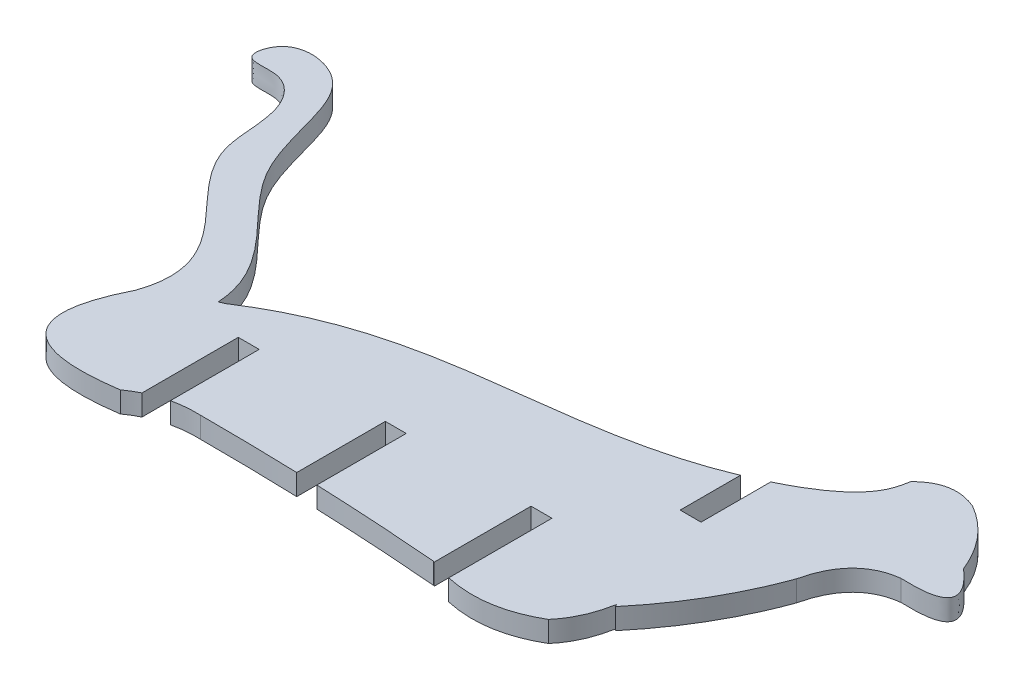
ISO-10303-21;
HEADER;
FILE_DESCRIPTION(('STEP AP214'),'2;1');
FILE_NAME('part.step','',(''),(''),'','','');
FILE_SCHEMA(('AUTOMOTIVE_DESIGN { 1 0 10303 214 1 1 1 1 }'));
ENDSEC;
DATA;
#1=APPLICATION_CONTEXT('core data for automotive mechanical design processes');
#2=APPLICATION_PROTOCOL_DEFINITION('international standard','automotive_design',2000,#1);
#3=PRODUCT_CONTEXT('',#1,'mechanical');
#4=PRODUCT('Part','Part','',(#3));
#5=PRODUCT_RELATED_PRODUCT_CATEGORY('part','',(#4));
#6=PRODUCT_DEFINITION_FORMATION('','',#4);
#7=PRODUCT_DEFINITION_CONTEXT('part definition',#1,'design');
#8=PRODUCT_DEFINITION('design','',#6,#7);
#9=PRODUCT_DEFINITION_SHAPE('','',#8);
#10=(LENGTH_UNIT() NAMED_UNIT(*) SI_UNIT(.MILLI.,.METRE.));
#11=(NAMED_UNIT(*) PLANE_ANGLE_UNIT() SI_UNIT($,.RADIAN.));
#12=(NAMED_UNIT(*) SI_UNIT($,.STERADIAN.) SOLID_ANGLE_UNIT());
#13=UNCERTAINTY_MEASURE_WITH_UNIT(LENGTH_MEASURE(1.E-05),#10,'distance_accuracy_value','');
#14=(GEOMETRIC_REPRESENTATION_CONTEXT(3) GLOBAL_UNCERTAINTY_ASSIGNED_CONTEXT((#13)) GLOBAL_UNIT_ASSIGNED_CONTEXT((#10,
#11,#12)) REPRESENTATION_CONTEXT('',''));
#15=CARTESIAN_POINT('',(0.,0.,0.));
#16=DIRECTION('',(0.,0.,1.));
#17=DIRECTION('',(1.,0.,0.));
#18=AXIS2_PLACEMENT_3D('',#15,#16,#17);
#19=CARTESIAN_POINT('',(75.5267501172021,3.,-42.9267503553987));
#20=CARTESIAN_POINT('',(73.2926366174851,3.,-48.5011073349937));
#21=CARTESIAN_POINT('',(68.4031861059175,3.,-51.3525451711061));
#22=B_SPLINE_CURVE_WITH_KNOTS('',2,(#19,#20,#21),.UNSPECIFIED.,.F.,.F.,(3,3),(0.,1.),.UNSPECIFIED.);
#23=DIRECTION('',(0.,-1.,0.));
#24=VECTOR('',#23,1.);
#25=SURFACE_OF_LINEAR_EXTRUSION('',#22,#24);
#26=CARTESIAN_POINT('',(75.5267501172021,0.,-42.9267503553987));
#27=CARTESIAN_POINT('',(73.2926366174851,0.,-48.5011073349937));
#28=CARTESIAN_POINT('',(68.4031861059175,0.,-51.3525451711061));
#29=B_SPLINE_CURVE_WITH_KNOTS('',2,(#26,#27,#28),.UNSPECIFIED.,.F.,.F.,(3,3),(0.,1.),.UNSPECIFIED.);
#30=CARTESIAN_POINT('',(75.5267501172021,0.,-42.9267503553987));
#31=VERTEX_POINT('',#30);
#32=CARTESIAN_POINT('',(68.4031861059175,0.,-51.3525451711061));
#33=VERTEX_POINT('',#32);
#34=EDGE_CURVE('E500',#31,#33,#29,.T.);
#35=ORIENTED_EDGE('',*,*,#34,.T.);
#36=DIRECTION('',(0.,-1.,0.));
#37=VECTOR('',#36,1.);
#38=CARTESIAN_POINT('',(68.4031861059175,3.,-51.3525451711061));
#39=LINE('',#38,#37);
#40=CARTESIAN_POINT('',(68.4031861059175,3.,-51.3525451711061));
#41=VERTEX_POINT('',#40);
#42=EDGE_CURVE('E11',#41,#33,#39,.T.);
#43=ORIENTED_EDGE('',*,*,#42,.F.);
#44=CARTESIAN_POINT('',(75.5267501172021,3.,-42.9267503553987));
#45=VERTEX_POINT('',#44);
#46=EDGE_CURVE('E632',#45,#41,#22,.T.);
#47=ORIENTED_EDGE('',*,*,#46,.F.);
#48=DIRECTION('',(0.,-1.,0.));
#49=VECTOR('',#48,1.);
#50=CARTESIAN_POINT('',(75.5267501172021,3.,-42.9267503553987));
#51=LINE('',#50,#49);
#52=EDGE_CURVE('E265',#45,#31,#51,.T.);
#53=ORIENTED_EDGE('',*,*,#52,.T.);
#54=EDGE_LOOP('',(#35,#43,#47,#53));
#55=FACE_BOUND('',#54,.T.);
#56=ADVANCED_FACE('F39',(#55),#25,.F.);
#57=CARTESIAN_POINT('',(68.4031861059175,3.,-51.3525451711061));
#58=CARTESIAN_POINT('',(64.0868815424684,3.,-53.226470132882));
#59=CARTESIAN_POINT('',(60.9012069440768,3.,-49.9551750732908));
#60=B_SPLINE_CURVE_WITH_KNOTS('',2,(#57,#58,#59),.UNSPECIFIED.,.F.,.F.,(3,3),(0.,1.),.UNSPECIFIED.);
#61=DIRECTION('',(0.,-1.,0.));
#62=VECTOR('',#61,1.);
#63=SURFACE_OF_LINEAR_EXTRUSION('',#60,#62);
#64=CARTESIAN_POINT('',(68.4031861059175,0.,-51.3525451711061));
#65=CARTESIAN_POINT('',(64.0868815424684,0.,-53.226470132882));
#66=CARTESIAN_POINT('',(60.9012069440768,0.,-49.9551750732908));
#67=B_SPLINE_CURVE_WITH_KNOTS('',2,(#64,#65,#66),.UNSPECIFIED.,.F.,.F.,(3,3),(0.,1.),.UNSPECIFIED.);
#68=CARTESIAN_POINT('',(60.9012069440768,0.,-49.9551750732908));
#69=VERTEX_POINT('',#68);
#70=EDGE_CURVE('E494',#33,#69,#67,.T.);
#71=ORIENTED_EDGE('',*,*,#70,.T.);
#72=DIRECTION('',(0.,-1.,0.));
#73=VECTOR('',#72,1.);
#74=CARTESIAN_POINT('',(60.9012069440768,3.,-49.9551750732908));
#75=LINE('',#74,#73);
#76=CARTESIAN_POINT('',(60.9012069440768,3.,-49.9551750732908));
#77=VERTEX_POINT('',#76);
#78=EDGE_CURVE('E48',#77,#69,#75,.T.);
#79=ORIENTED_EDGE('',*,*,#78,.F.);
#80=EDGE_CURVE('E165',#41,#77,#60,.T.);
#81=ORIENTED_EDGE('',*,*,#80,.F.);
#82=ORIENTED_EDGE('',*,*,#42,.T.);
#83=EDGE_LOOP('',(#71,#79,#81,#82));
#84=FACE_BOUND('',#83,.T.);
#85=ADVANCED_FACE('F663',(#84),#63,.F.);
#86=CARTESIAN_POINT('',(60.9012069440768,3.,-49.9551750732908));
#87=CARTESIAN_POINT('',(60.7554698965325,3.,-49.0949870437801));
#88=CARTESIAN_POINT('',(59.8189565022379,3.,-44.9436530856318));
#89=CARTESIAN_POINT('',(54.8907492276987,3.,-41.8215062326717));
#90=CARTESIAN_POINT('',(50.8937591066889,3.,-39.8804155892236));
#91=B_SPLINE_CURVE_WITH_KNOTS('',3,(#86,#87,#88,#89,#90),.UNSPECIFIED.,.F.,.F.,(4,1,4),
(0.191058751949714,0.219406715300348,0.344529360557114),.UNSPECIFIED.);
#92=DIRECTION('',(0.,-1.,0.));
#93=VECTOR('',#92,1.);
#94=SURFACE_OF_LINEAR_EXTRUSION('',#91,#93);
#95=CARTESIAN_POINT('',(60.9012069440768,0.,-49.9551750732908));
#96=CARTESIAN_POINT('',(60.7554698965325,0.,-49.0949870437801));
#97=CARTESIAN_POINT('',(59.8189565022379,0.,-44.9436530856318));
#98=CARTESIAN_POINT('',(54.8907492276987,0.,-41.8215062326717));
#99=CARTESIAN_POINT('',(50.8937591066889,0.,-39.8804155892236));
#100=B_SPLINE_CURVE_WITH_KNOTS('',3,(#95,#96,#97,#98,#99),.UNSPECIFIED.,.F.,.F.,(4,1,4),
(0.191058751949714,0.219406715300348,0.344529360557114),.UNSPECIFIED.);
#101=CARTESIAN_POINT('',(50.8937591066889,0.,-39.8804155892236));
#102=VERTEX_POINT('',#101);
#103=EDGE_CURVE('E488',#69,#102,#100,.T.);
#104=ORIENTED_EDGE('',*,*,#103,.T.);
#105=DIRECTION('',(0.,-1.,0.));
#106=VECTOR('',#105,1.);
#107=CARTESIAN_POINT('',(50.8937591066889,3.,-39.8804155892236));
#108=LINE('',#107,#106);
#109=CARTESIAN_POINT('',(50.8937591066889,3.,-39.8804155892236));
#110=VERTEX_POINT('',#109);
#111=EDGE_CURVE('E480',#110,#102,#108,.T.);
#112=ORIENTED_EDGE('',*,*,#111,.F.);
#113=EDGE_CURVE('E489',#77,#110,#91,.T.);
#114=ORIENTED_EDGE('',*,*,#113,.F.);
#115=ORIENTED_EDGE('',*,*,#78,.T.);
#116=EDGE_LOOP('',(#104,#112,#114,#115));
#117=FACE_BOUND('',#116,.T.);
#118=ADVANCED_FACE('F486',(#117),#94,.F.);
#119=CARTESIAN_POINT('',(50.8937591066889,3.,-39.8804155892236));
#120=DIRECTION('',(1.,0.,0.));
#121=DIRECTION('',(0.,0.,-1.));
#122=AXIS2_PLACEMENT_3D('',#119,#120,#121);
#123=PLANE('',#122);
#124=DIRECTION('',(0.,0.,1.));
#125=VECTOR('',#124,1.);
#126=CARTESIAN_POINT('',(50.8937591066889,0.,-39.8804155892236));
#127=LINE('',#126,#125);
#128=CARTESIAN_POINT('',(50.8937591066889,0.,-29.8804155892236));
#129=VERTEX_POINT('',#128);
#130=EDGE_CURVE('E496',#102,#129,#127,.T.);
#131=ORIENTED_EDGE('',*,*,#130,.T.);
#132=DIRECTION('',(0.,-1.,0.));
#133=VECTOR('',#132,1.);
#134=CARTESIAN_POINT('',(50.8937591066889,3.,-29.8804155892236));
#135=LINE('',#134,#133);
#136=CARTESIAN_POINT('',(50.8937591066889,3.,-29.8804155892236));
#137=VERTEX_POINT('',#136);
#138=EDGE_CURVE('E477',#137,#129,#135,.T.);
#139=ORIENTED_EDGE('',*,*,#138,.F.);
#140=DIRECTION('',(0.,0.,1.));
#141=VECTOR('',#140,1.);
#142=CARTESIAN_POINT('',(50.8937591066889,3.,-39.8804155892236));
#143=LINE('',#142,#141);
#144=EDGE_CURVE('E795',#110,#137,#143,.T.);
#145=ORIENTED_EDGE('',*,*,#144,.F.);
#146=ORIENTED_EDGE('',*,*,#111,.T.);
#147=EDGE_LOOP('',(#131,#139,#145,#146));
#148=FACE_BOUND('',#147,.T.);
#149=ADVANCED_FACE('F668',(#148),#123,.F.);
#150=CARTESIAN_POINT('',(50.8937591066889,3.,-29.8804155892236));
#151=DIRECTION('',(0.,0.,1.));
#152=DIRECTION('',(1.,0.,0.));
#153=AXIS2_PLACEMENT_3D('',#150,#151,#152);
#154=PLANE('',#153);
#155=DIRECTION('',(-1.,0.,0.));
#156=VECTOR('',#155,1.);
#157=CARTESIAN_POINT('',(50.8937591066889,0.,-29.8804155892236));
#158=LINE('',#157,#156);
#159=CARTESIAN_POINT('',(47.8937591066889,0.,-29.8804155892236));
#160=VERTEX_POINT('',#159);
#161=EDGE_CURVE('E498',#129,#160,#158,.T.);
#162=ORIENTED_EDGE('',*,*,#161,.T.);
#163=DIRECTION('',(0.,-1.,0.));
#164=VECTOR('',#163,1.);
#165=CARTESIAN_POINT('',(47.8937591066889,3.,-29.8804155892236));
#166=LINE('',#165,#164);
#167=CARTESIAN_POINT('',(47.8937591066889,3.,-29.8804155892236));
#168=VERTEX_POINT('',#167);
#169=EDGE_CURVE('E475',#168,#160,#166,.T.);
#170=ORIENTED_EDGE('',*,*,#169,.F.);
#171=DIRECTION('',(-1.,0.,0.));
#172=VECTOR('',#171,1.);
#173=CARTESIAN_POINT('',(50.8937591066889,3.,-29.8804155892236));
#174=LINE('',#173,#172);
#175=EDGE_CURVE('E793',#137,#168,#174,.T.);
#176=ORIENTED_EDGE('',*,*,#175,.F.);
#177=ORIENTED_EDGE('',*,*,#138,.T.);
#178=EDGE_LOOP('',(#162,#170,#176,#177));
#179=FACE_BOUND('',#178,.T.);
#180=ADVANCED_FACE('F671',(#179),#154,.F.);
#181=CARTESIAN_POINT('',(47.8937591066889,3.,-38.5314242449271));
#182=DIRECTION('',(1.,0.,0.));
#183=DIRECTION('',(0.,0.,-1.));
#184=AXIS2_PLACEMENT_3D('',#181,#182,#183);
#185=PLANE('',#184);
#186=DIRECTION('',(0.,0.,1.));
#187=VECTOR('',#186,1.);
#188=CARTESIAN_POINT('',(47.8937591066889,0.,-38.5314242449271));
#189=LINE('',#188,#187);
#190=CARTESIAN_POINT('',(47.8937591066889,0.,-38.5314242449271));
#191=VERTEX_POINT('',#190);
#192=EDGE_CURVE('E512',#191,#160,#189,.T.);
#193=ORIENTED_EDGE('',*,*,#192,.F.);
#194=DIRECTION('',(0.,-1.,0.));
#195=VECTOR('',#194,1.);
#196=CARTESIAN_POINT('',(47.8937591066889,3.,-38.5314242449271));
#197=LINE('',#196,#195);
#198=CARTESIAN_POINT('',(47.8937591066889,3.,-38.5314242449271));
#199=VERTEX_POINT('',#198);
#200=EDGE_CURVE('E473',#199,#191,#197,.T.);
#201=ORIENTED_EDGE('',*,*,#200,.F.);
#202=DIRECTION('',(0.,0.,1.));
#203=VECTOR('',#202,1.);
#204=CARTESIAN_POINT('',(47.8937591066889,3.,-38.5314242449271));
#205=LINE('',#204,#203);
#206=EDGE_CURVE('E694',#199,#168,#205,.T.);
#207=ORIENTED_EDGE('',*,*,#206,.T.);
#208=ORIENTED_EDGE('',*,*,#169,.T.);
#209=EDGE_LOOP('',(#193,#201,#207,#208));
#210=FACE_BOUND('',#209,.T.);
#211=ADVANCED_FACE('F675',(#210),#185,.T.);
#212=CARTESIAN_POINT('',(47.8937591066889,3.,-38.5314242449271));
#213=CARTESIAN_POINT('',(28.0082246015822,3.,-30.2806403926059));
#214=CARTESIAN_POINT('',(8.63555087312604,3.,-35.4977104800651));
#215=CARTESIAN_POINT('',(-10.3741587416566,3.,-22.9360710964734));
#216=B_SPLINE_CURVE_WITH_KNOTS('',3,(#212,#213,#214,#215),.UNSPECIFIED.,.F.,.F.,(4,4),
(0.375874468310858,1.),.UNSPECIFIED.);
#217=DIRECTION('',(0.,-1.,0.));
#218=VECTOR('',#217,1.);
#219=SURFACE_OF_LINEAR_EXTRUSION('',#216,#218);
#220=CARTESIAN_POINT('',(47.8937591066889,0.,-38.5314242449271));
#221=CARTESIAN_POINT('',(28.0082246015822,0.,-30.2806403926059));
#222=CARTESIAN_POINT('',(8.63555087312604,0.,-35.4977104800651));
#223=CARTESIAN_POINT('',(-10.3741587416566,0.,-22.9360710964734));
#224=B_SPLINE_CURVE_WITH_KNOTS('',3,(#220,#221,#222,#223),.UNSPECIFIED.,.F.,.F.,(4,4),
(0.375874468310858,1.),.UNSPECIFIED.);
#225=CARTESIAN_POINT('',(-10.3741587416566,0.,-22.9360710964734));
#226=VERTEX_POINT('',#225);
#227=EDGE_CURVE('E515',#191,#226,#224,.T.);
#228=ORIENTED_EDGE('',*,*,#227,.T.);
#229=DIRECTION('',(0.,-1.,0.));
#230=VECTOR('',#229,1.);
#231=CARTESIAN_POINT('',(-10.3741587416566,3.,-22.9360710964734));
#232=LINE('',#231,#230);
#233=CARTESIAN_POINT('',(-10.3741587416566,3.,-22.9360710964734));
#234=VERTEX_POINT('',#233);
#235=EDGE_CURVE('E471',#234,#226,#232,.T.);
#236=ORIENTED_EDGE('',*,*,#235,.F.);
#237=EDGE_CURVE('E688',#199,#234,#216,.T.);
#238=ORIENTED_EDGE('',*,*,#237,.F.);
#239=ORIENTED_EDGE('',*,*,#200,.T.);
#240=EDGE_LOOP('',(#228,#236,#238,#239));
#241=FACE_BOUND('',#240,.T.);
#242=ADVANCED_FACE('F679',(#241),#219,.F.);
#243=CARTESIAN_POINT('',(-11.1356610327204,3.,-22.6005868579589));
#244=CARTESIAN_POINT('',(-10.8830760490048,3.,-22.7149187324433));
#245=CARTESIAN_POINT('',(-10.6292179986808,3.,-22.8267266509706));
#246=CARTESIAN_POINT('',(-10.3741587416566,3.,-22.9360710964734));
#247=B_SPLINE_CURVE_WITH_KNOTS('',3,(#243,#244,#245,#246),.UNSPECIFIED.,.F.,.F.,(4,4),
(0.550254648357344,0.571137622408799),.UNSPECIFIED.);
#248=DIRECTION('',(0.,-1.,0.));
#249=VECTOR('',#248,1.);
#250=SURFACE_OF_LINEAR_EXTRUSION('',#247,#249);
#251=CARTESIAN_POINT('',(-11.1356610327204,0.,-22.6005868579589));
#252=CARTESIAN_POINT('',(-10.8830760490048,0.,-22.7149187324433));
#253=CARTESIAN_POINT('',(-10.6292179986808,0.,-22.8267266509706));
#254=CARTESIAN_POINT('',(-10.3741587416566,0.,-22.9360710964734));
#255=B_SPLINE_CURVE_WITH_KNOTS('',3,(#251,#252,#253,#254),.UNSPECIFIED.,.F.,.F.,(4,4),
(0.550254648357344,0.571137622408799),.UNSPECIFIED.);
#256=CARTESIAN_POINT('',(-11.1356610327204,0.,-22.6005868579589));
#257=VERTEX_POINT('',#256);
#258=EDGE_CURVE('E520',#257,#226,#255,.T.);
#259=ORIENTED_EDGE('',*,*,#258,.F.);
#260=DIRECTION('',(0.,-1.,0.));
#261=VECTOR('',#260,1.);
#262=CARTESIAN_POINT('',(-11.1356610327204,3.,-22.6005868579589));
#263=LINE('',#262,#261);
#264=CARTESIAN_POINT('',(-11.1356610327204,3.,-22.6005868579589));
#265=VERTEX_POINT('',#264);
#266=EDGE_CURVE('E469',#265,#257,#263,.T.);
#267=ORIENTED_EDGE('',*,*,#266,.F.);
#268=EDGE_CURVE('E693',#265,#234,#247,.T.);
#269=ORIENTED_EDGE('',*,*,#268,.T.);
#270=ORIENTED_EDGE('',*,*,#235,.T.);
#271=EDGE_LOOP('',(#259,#267,#269,#270));
#272=FACE_BOUND('',#271,.T.);
#273=ADVANCED_FACE('F684',(#272),#250,.T.);
#274=CARTESIAN_POINT('',(-18.5169229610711,3.,-18.1507684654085));
#275=CARTESIAN_POINT('',(-14.5119069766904,3.,-29.5343408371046));
#276=CARTESIAN_POINT('',(-31.9797482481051,3.,-35.3707884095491));
#277=CARTESIAN_POINT('',(-29.751622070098,3.,-50.7343949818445));
#278=CARTESIAN_POINT('',(-34.4462313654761,3.,-55.8402008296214));
#279=CARTESIAN_POINT('',(-40.1218133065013,3.,-54.4079761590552));
#280=CARTESIAN_POINT('',(-38.519478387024,3.,-60.889337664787));
#281=CARTESIAN_POINT('',(-29.6520657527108,3.,-59.951009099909));
#282=CARTESIAN_POINT('',(-26.7788534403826,3.,-51.1561648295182));
#283=CARTESIAN_POINT('',(-23.5382847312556,3.,-37.4118977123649));
#284=CARTESIAN_POINT('',(-11.646426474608,3.,-31.263472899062));
#285=CARTESIAN_POINT('',(-11.1356610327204,3.,-22.6005868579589));
#286=B_SPLINE_CURVE_WITH_KNOTS('',3,(#274,#275,#276,#277,#278,#279,#280,#281,#282,#283,#284,
#285),.UNSPECIFIED.,.F.,.F.,(4,1,1,1,1,1,1,1,1,4),(0.,0.276371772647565,0.375366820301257,
0.42621598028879,0.467018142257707,0.496246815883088,0.571537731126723,0.65596278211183,
0.760228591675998,1.),.UNSPECIFIED.);
#287=DIRECTION('',(0.,-1.,0.));
#288=VECTOR('',#287,1.);
#289=SURFACE_OF_LINEAR_EXTRUSION('',#286,#288);
#290=CARTESIAN_POINT('',(-18.5169229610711,0.,-18.1507684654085));
#291=CARTESIAN_POINT('',(-14.5119069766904,0.,-29.5343408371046));
#292=CARTESIAN_POINT('',(-31.9797482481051,0.,-35.3707884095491));
#293=CARTESIAN_POINT('',(-29.751622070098,0.,-50.7343949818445));
#294=CARTESIAN_POINT('',(-34.4462313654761,0.,-55.8402008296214));
#295=CARTESIAN_POINT('',(-40.1218133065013,0.,-54.4079761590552));
#296=CARTESIAN_POINT('',(-38.519478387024,0.,-60.889337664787));
#297=CARTESIAN_POINT('',(-29.6520657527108,0.,-59.951009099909));
#298=CARTESIAN_POINT('',(-26.7788534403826,0.,-51.1561648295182));
#299=CARTESIAN_POINT('',(-23.5382847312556,0.,-37.4118977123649));
#300=CARTESIAN_POINT('',(-11.646426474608,0.,-31.263472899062));
#301=CARTESIAN_POINT('',(-11.1356610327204,0.,-22.6005868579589));
#302=B_SPLINE_CURVE_WITH_KNOTS('',3,(#290,#291,#292,#293,#294,#295,#296,#297,#298,#299,#300,
#301),.UNSPECIFIED.,.F.,.F.,(4,1,1,1,1,1,1,1,1,4),(0.,0.276371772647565,0.375366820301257,
0.42621598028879,0.467018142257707,0.496246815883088,0.571537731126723,0.65596278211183,
0.760228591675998,1.),.UNSPECIFIED.);
#303=CARTESIAN_POINT('',(-18.5169229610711,0.,-18.1507684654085));
#304=VERTEX_POINT('',#303);
#305=EDGE_CURVE('E528',#304,#257,#302,.T.);
#306=ORIENTED_EDGE('',*,*,#305,.F.);
#307=DIRECTION('',(0.,-1.,0.));
#308=VECTOR('',#307,1.);
#309=CARTESIAN_POINT('',(-18.5169229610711,3.,-18.1507684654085));
#310=LINE('',#309,#308);
#311=CARTESIAN_POINT('',(-18.5169229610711,3.,-18.1507684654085));
#312=VERTEX_POINT('',#311);
#313=EDGE_CURVE('E467',#312,#304,#310,.T.);
#314=ORIENTED_EDGE('',*,*,#313,.F.);
#315=EDGE_CURVE('E704',#312,#265,#286,.T.);
#316=ORIENTED_EDGE('',*,*,#315,.T.);
#317=ORIENTED_EDGE('',*,*,#266,.T.);
#318=EDGE_LOOP('',(#306,#314,#316,#317));
#319=FACE_BOUND('',#318,.T.);
#320=ADVANCED_FACE('F721',(#319),#289,.T.);
#321=CARTESIAN_POINT('',(-18.5169229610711,3.,-18.1507684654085));
#322=CARTESIAN_POINT('',(-26.7522707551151,3.,-1.77084566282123));
#323=CARTESIAN_POINT('',(-7.23371668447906,3.,-4.64367499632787));
#324=B_SPLINE_CURVE_WITH_KNOTS('',2,(#321,#322,#323),.UNSPECIFIED.,.F.,.F.,(3,3),(0.,1.),.UNSPECIFIED.);
#325=DIRECTION('',(0.,-1.,0.));
#326=VECTOR('',#325,1.);
#327=SURFACE_OF_LINEAR_EXTRUSION('',#324,#326);
#328=CARTESIAN_POINT('',(-18.5169229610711,0.,-18.1507684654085));
#329=CARTESIAN_POINT('',(-26.7522707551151,0.,-1.77084566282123));
#330=CARTESIAN_POINT('',(-7.23371668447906,0.,-4.64367499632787));
#331=B_SPLINE_CURVE_WITH_KNOTS('',2,(#328,#329,#330),.UNSPECIFIED.,.F.,.F.,(3,3),(0.,1.),.UNSPECIFIED.);
#332=CARTESIAN_POINT('',(-7.23371668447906,0.,-4.64367499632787));
#333=VERTEX_POINT('',#332);
#334=EDGE_CURVE('E536',#304,#333,#331,.T.);
#335=ORIENTED_EDGE('',*,*,#334,.T.);
#336=DIRECTION('',(0.,-1.,0.));
#337=VECTOR('',#336,1.);
#338=CARTESIAN_POINT('',(-7.23371668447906,3.,-4.64367499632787));
#339=LINE('',#338,#337);
#340=CARTESIAN_POINT('',(-7.23371668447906,3.,-4.64367499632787));
#341=VERTEX_POINT('',#340);
#342=EDGE_CURVE('E465',#341,#333,#339,.T.);
#343=ORIENTED_EDGE('',*,*,#342,.F.);
#344=EDGE_CURVE('E713',#312,#341,#324,.T.);
#345=ORIENTED_EDGE('',*,*,#344,.F.);
#346=ORIENTED_EDGE('',*,*,#313,.T.);
#347=EDGE_LOOP('',(#335,#343,#345,#346));
#348=FACE_BOUND('',#347,.T.);
#349=ADVANCED_FACE('F724',(#348),#327,.F.);
#350=CARTESIAN_POINT('',(-5.29340051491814,3.,-5.82263575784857));
#351=CARTESIAN_POINT('',(-5.96443170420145,3.,-5.48790715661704));
#352=CARTESIAN_POINT('',(-6.61120376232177,3.,-5.09492023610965));
#353=CARTESIAN_POINT('',(-7.23371668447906,3.,-4.64367499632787));
#354=B_SPLINE_CURVE_WITH_KNOTS('',3,(#350,#351,#352,#353),.UNSPECIFIED.,.F.,.F.,(4,4),
(0.757247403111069,1.),.UNSPECIFIED.);
#355=DIRECTION('',(0.,-1.,0.));
#356=VECTOR('',#355,1.);
#357=SURFACE_OF_LINEAR_EXTRUSION('',#354,#356);
#358=CARTESIAN_POINT('',(-5.29340051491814,0.,-5.82263575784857));
#359=CARTESIAN_POINT('',(-5.96443170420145,0.,-5.48790715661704));
#360=CARTESIAN_POINT('',(-6.61120376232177,0.,-5.09492023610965));
#361=CARTESIAN_POINT('',(-7.23371668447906,0.,-4.64367499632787));
#362=B_SPLINE_CURVE_WITH_KNOTS('',3,(#358,#359,#360,#361),.UNSPECIFIED.,.F.,.F.,(4,4),
(0.757247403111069,1.),.UNSPECIFIED.);
#363=CARTESIAN_POINT('',(-5.29340051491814,0.,-5.82263575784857));
#364=VERTEX_POINT('',#363);
#365=EDGE_CURVE('E544',#364,#333,#362,.T.);
#366=ORIENTED_EDGE('',*,*,#365,.F.);
#367=DIRECTION('',(0.,-1.,0.));
#368=VECTOR('',#367,1.);
#369=CARTESIAN_POINT('',(-5.29340051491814,3.,-5.82263575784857));
#370=LINE('',#369,#368);
#371=CARTESIAN_POINT('',(-5.29340051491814,3.,-5.82263575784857));
#372=VERTEX_POINT('',#371);
#373=EDGE_CURVE('E463',#372,#364,#370,.T.);
#374=ORIENTED_EDGE('',*,*,#373,.F.);
#375=EDGE_CURVE('E735',#372,#341,#354,.T.);
#376=ORIENTED_EDGE('',*,*,#375,.T.);
#377=ORIENTED_EDGE('',*,*,#342,.T.);
#378=EDGE_LOOP('',(#366,#374,#376,#377));
#379=FACE_BOUND('',#378,.T.);
#380=ADVANCED_FACE('F728',(#379),#357,.T.);
#381=CARTESIAN_POINT('',(-5.29340051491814,3.,-19.6436749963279));
#382=DIRECTION('',(1.,0.,0.));
#383=DIRECTION('',(0.,0.,-1.));
#384=AXIS2_PLACEMENT_3D('',#381,#382,#383);
#385=PLANE('',#384);
#386=DIRECTION('',(0.,0.,1.));
#387=VECTOR('',#386,1.);
#388=CARTESIAN_POINT('',(-5.29340051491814,0.,-19.6436749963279));
#389=LINE('',#388,#387);
#390=CARTESIAN_POINT('',(-5.29340051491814,0.,-19.6436749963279));
#391=VERTEX_POINT('',#390);
#392=EDGE_CURVE('E552',#391,#364,#389,.T.);
#393=ORIENTED_EDGE('',*,*,#392,.F.);
#394=DIRECTION('',(0.,-1.,0.));
#395=VECTOR('',#394,1.);
#396=CARTESIAN_POINT('',(-5.29340051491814,3.,-19.6436749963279));
#397=LINE('',#396,#395);
#398=CARTESIAN_POINT('',(-5.29340051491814,3.,-19.6436749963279));
#399=VERTEX_POINT('',#398);
#400=EDGE_CURVE('E461',#399,#391,#397,.T.);
#401=ORIENTED_EDGE('',*,*,#400,.F.);
#402=DIRECTION('',(0.,0.,1.));
#403=VECTOR('',#402,1.);
#404=CARTESIAN_POINT('',(-5.29340051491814,3.,-19.6436749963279));
#405=LINE('',#404,#403);
#406=EDGE_CURVE('E741',#399,#372,#405,.T.);
#407=ORIENTED_EDGE('',*,*,#406,.T.);
#408=ORIENTED_EDGE('',*,*,#373,.T.);
#409=EDGE_LOOP('',(#393,#401,#407,#408));
#410=FACE_BOUND('',#409,.T.);
#411=ADVANCED_FACE('F732',(#410),#385,.T.);
#412=CARTESIAN_POINT('',(-5.29340051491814,3.,-19.6436749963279));
#413=DIRECTION('',(0.,0.,-1.));
#414=DIRECTION('',(-1.,0.,0.));
#415=AXIS2_PLACEMENT_3D('',#412,#413,#414);
#416=PLANE('',#415);
#417=DIRECTION('',(1.,0.,0.));
#418=VECTOR('',#417,1.);
#419=CARTESIAN_POINT('',(-5.29340051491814,0.,-19.6436749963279));
#420=LINE('',#419,#418);
#421=CARTESIAN_POINT('',(-2.29340050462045,0.,-19.6436749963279));
#422=VERTEX_POINT('',#421);
#423=EDGE_CURVE('E558',#391,#422,#420,.T.);
#424=ORIENTED_EDGE('',*,*,#423,.T.);
#425=DIRECTION('',(0.,-1.,0.));
#426=VECTOR('',#425,1.);
#427=CARTESIAN_POINT('',(-2.29340050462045,3.,-19.6436749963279));
#428=LINE('',#427,#426);
#429=CARTESIAN_POINT('',(-2.29340050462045,3.,-19.6436749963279));
#430=VERTEX_POINT('',#429);
#431=EDGE_CURVE('E458',#430,#422,#428,.T.);
#432=ORIENTED_EDGE('',*,*,#431,.F.);
#433=DIRECTION('',(1.,0.,0.));
#434=VECTOR('',#433,1.);
#435=CARTESIAN_POINT('',(-5.29340051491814,3.,-19.6436749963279));
#436=LINE('',#435,#434);
#437=EDGE_CURVE('E747',#399,#430,#436,.T.);
#438=ORIENTED_EDGE('',*,*,#437,.F.);
#439=ORIENTED_EDGE('',*,*,#400,.T.);
#440=EDGE_LOOP('',(#424,#432,#438,#439));
#441=FACE_BOUND('',#440,.T.);
#442=ADVANCED_FACE('F771',(#441),#416,.F.);
#443=CARTESIAN_POINT('',(-2.29340050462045,3.,-19.6436749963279));
#444=DIRECTION('',(1.,0.,0.));
#445=DIRECTION('',(0.,0.,-1.));
#446=AXIS2_PLACEMENT_3D('',#443,#444,#445);
#447=PLANE('',#446);
#448=DIRECTION('',(0.,0.,1.));
#449=VECTOR('',#448,1.);
#450=CARTESIAN_POINT('',(-2.29340050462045,0.,-19.6436749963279));
#451=LINE('',#450,#449);
#452=CARTESIAN_POINT('',(-2.29340050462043,0.,-6.89494034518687));
#453=VERTEX_POINT('',#452);
#454=EDGE_CURVE('E560',#422,#453,#451,.T.);
#455=ORIENTED_EDGE('',*,*,#454,.T.);
#456=DIRECTION('',(0.,-1.,0.));
#457=VECTOR('',#456,1.);
#458=CARTESIAN_POINT('',(-2.29340050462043,3.,-6.89494034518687));
#459=LINE('',#458,#457);
#460=CARTESIAN_POINT('',(-2.29340050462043,3.,-6.89494034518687));
#461=VERTEX_POINT('',#460);
#462=EDGE_CURVE('E456',#461,#453,#459,.T.);
#463=ORIENTED_EDGE('',*,*,#462,.F.);
#464=DIRECTION('',(0.,0.,1.));
#465=VECTOR('',#464,1.);
#466=CARTESIAN_POINT('',(-2.29340050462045,3.,-19.6436749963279));
#467=LINE('',#466,#465);
#468=EDGE_CURVE('E748',#430,#461,#467,.T.);
#469=ORIENTED_EDGE('',*,*,#468,.F.);
#470=ORIENTED_EDGE('',*,*,#431,.T.);
#471=EDGE_LOOP('',(#455,#463,#469,#470));
#472=FACE_BOUND('',#471,.T.);
#473=ADVANCED_FACE('F767',(#472),#447,.F.);
#474=CARTESIAN_POINT('',(1.69446574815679,3.,-7.25441614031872));
#475=CARTESIAN_POINT('',(-0.404856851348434,3.,-7.32777111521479));
#476=CARTESIAN_POINT('',(-2.29340050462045,3.,-6.89494034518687));
#477=B_SPLINE_CURVE_WITH_KNOTS('',2,(#474,#475,#476),.UNSPECIFIED.,.F.,.F.,(3,3),(0.,
0.413122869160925),.UNSPECIFIED.);
#478=DIRECTION('',(0.,-1.,0.));
#479=VECTOR('',#478,1.);
#480=SURFACE_OF_LINEAR_EXTRUSION('',#477,#479);
#481=CARTESIAN_POINT('',(1.69446574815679,0.,-7.25441614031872));
#482=CARTESIAN_POINT('',(-0.404856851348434,0.,-7.32777111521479));
#483=CARTESIAN_POINT('',(-2.29340050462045,0.,-6.89494034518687));
#484=B_SPLINE_CURVE_WITH_KNOTS('',2,(#481,#482,#483),.UNSPECIFIED.,.F.,.F.,(3,3),(0.,
0.413122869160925),.UNSPECIFIED.);
#485=CARTESIAN_POINT('',(1.69446574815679,0.,-7.25441614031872));
#486=VERTEX_POINT('',#485);
#487=EDGE_CURVE('E563',#486,#453,#484,.T.);
#488=ORIENTED_EDGE('',*,*,#487,.F.);
#489=DIRECTION('',(0.,-1.,0.));
#490=VECTOR('',#489,1.);
#491=CARTESIAN_POINT('',(1.69446574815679,3.,-7.25441614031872));
#492=LINE('',#491,#490);
#493=CARTESIAN_POINT('',(1.69446574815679,3.,-7.25441614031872));
#494=VERTEX_POINT('',#493);
#495=EDGE_CURVE('E454',#494,#486,#492,.T.);
#496=ORIENTED_EDGE('',*,*,#495,.F.);
#497=EDGE_CURVE('E376',#494,#461,#477,.T.);
#498=ORIENTED_EDGE('',*,*,#497,.T.);
#499=ORIENTED_EDGE('',*,*,#462,.T.);
#500=EDGE_LOOP('',(#488,#496,#498,#499));
#501=FACE_BOUND('',#500,.T.);
#502=ADVANCED_FACE('F365',(#501),#480,.T.);
#503=CARTESIAN_POINT('',(15.7065994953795,3.,-7.03183954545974));
#504=CARTESIAN_POINT('',(11.0380928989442,3.,-7.18430130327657));
#505=CARTESIAN_POINT('',(6.36738165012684,3.,-7.25849350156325));
#506=CARTESIAN_POINT('',(1.69446574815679,3.,-7.25441614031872));
#507=B_SPLINE_CURVE_WITH_KNOTS('',3,(#503,#504,#505,#506),.UNSPECIFIED.,.F.,.F.,(4,4),
(0.702434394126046,1.),.UNSPECIFIED.);
#508=DIRECTION('',(0.,-1.,0.));
#509=VECTOR('',#508,1.);
#510=SURFACE_OF_LINEAR_EXTRUSION('',#507,#509);
#511=CARTESIAN_POINT('',(15.7065994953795,0.,-7.03183954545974));
#512=CARTESIAN_POINT('',(11.0380928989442,0.,-7.18430130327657));
#513=CARTESIAN_POINT('',(6.36738165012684,0.,-7.25849350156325));
#514=CARTESIAN_POINT('',(1.69446574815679,0.,-7.25441614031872));
#515=B_SPLINE_CURVE_WITH_KNOTS('',3,(#511,#512,#513,#514),.UNSPECIFIED.,.F.,.F.,(4,4),
(0.702434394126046,1.),.UNSPECIFIED.);
#516=CARTESIAN_POINT('',(15.7065994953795,0.,-7.03183954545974));
#517=VERTEX_POINT('',#516);
#518=EDGE_CURVE('E568',#517,#486,#515,.T.);
#519=ORIENTED_EDGE('',*,*,#518,.F.);
#520=DIRECTION('',(0.,-1.,0.));
#521=VECTOR('',#520,1.);
#522=CARTESIAN_POINT('',(15.7065994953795,3.,-7.03183954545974));
#523=LINE('',#522,#521);
#524=CARTESIAN_POINT('',(15.7065994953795,3.,-7.03183954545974));
#525=VERTEX_POINT('',#524);
#526=EDGE_CURVE('E452',#525,#517,#523,.T.);
#527=ORIENTED_EDGE('',*,*,#526,.F.);
#528=EDGE_CURVE('E369',#525,#494,#507,.T.);
#529=ORIENTED_EDGE('',*,*,#528,.T.);
#530=ORIENTED_EDGE('',*,*,#495,.T.);
#531=EDGE_LOOP('',(#519,#527,#529,#530));
#532=FACE_BOUND('',#531,.T.);
#533=ADVANCED_FACE('F360',(#532),#510,.T.);
#534=CARTESIAN_POINT('',(15.7065994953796,3.,-19.7493601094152));
#535=DIRECTION('',(1.,0.,0.));
#536=DIRECTION('',(0.,0.,-1.));
#537=AXIS2_PLACEMENT_3D('',#534,#535,#536);
#538=PLANE('',#537);
#539=DIRECTION('',(0.,0.,1.));
#540=VECTOR('',#539,1.);
#541=CARTESIAN_POINT('',(15.7065994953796,0.,-19.7493601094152));
#542=LINE('',#541,#540);
#543=CARTESIAN_POINT('',(15.7065994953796,0.,-19.7493601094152));
#544=VERTEX_POINT('',#543);
#545=EDGE_CURVE('E576',#544,#517,#542,.T.);
#546=ORIENTED_EDGE('',*,*,#545,.F.);
#547=DIRECTION('',(0.,-1.,0.));
#548=VECTOR('',#547,1.);
#549=CARTESIAN_POINT('',(15.7065994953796,3.,-19.7493601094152));
#550=LINE('',#549,#548);
#551=CARTESIAN_POINT('',(15.7065994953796,3.,-19.7493601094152));
#552=VERTEX_POINT('',#551);
#553=EDGE_CURVE('E450',#552,#544,#550,.T.);
#554=ORIENTED_EDGE('',*,*,#553,.F.);
#555=DIRECTION('',(0.,0.,1.));
#556=VECTOR('',#555,1.);
#557=CARTESIAN_POINT('',(15.7065994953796,3.,-19.7493601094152));
#558=LINE('',#557,#556);
#559=EDGE_CURVE('E375',#552,#525,#558,.T.);
#560=ORIENTED_EDGE('',*,*,#559,.T.);
#561=ORIENTED_EDGE('',*,*,#526,.T.);
#562=EDGE_LOOP('',(#546,#554,#560,#561));
#563=FACE_BOUND('',#562,.T.);
#564=ADVANCED_FACE('F356',(#563),#538,.T.);
#565=CARTESIAN_POINT('',(15.7065994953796,3.,-19.7493601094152));
#566=DIRECTION('',(0.,0.,-1.));
#567=DIRECTION('',(-1.,0.,0.));
#568=AXIS2_PLACEMENT_3D('',#565,#566,#567);
#569=PLANE('',#568);
#570=DIRECTION('',(1.,0.,0.));
#571=VECTOR('',#570,1.);
#572=CARTESIAN_POINT('',(15.7065994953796,0.,-19.7493601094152));
#573=LINE('',#572,#571);
#574=CARTESIAN_POINT('',(18.7065995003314,0.,-19.7493601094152));
#575=VERTEX_POINT('',#574);
#576=EDGE_CURVE('E582',#544,#575,#573,.T.);
#577=ORIENTED_EDGE('',*,*,#576,.T.);
#578=DIRECTION('',(0.,-1.,0.));
#579=VECTOR('',#578,1.);
#580=CARTESIAN_POINT('',(18.7065995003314,3.,-19.7493601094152));
#581=LINE('',#580,#579);
#582=CARTESIAN_POINT('',(18.7065995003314,3.,-19.7493601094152));
#583=VERTEX_POINT('',#582);
#584=EDGE_CURVE('E447',#583,#575,#581,.T.);
#585=ORIENTED_EDGE('',*,*,#584,.F.);
#586=DIRECTION('',(1.,0.,0.));
#587=VECTOR('',#586,1.);
#588=CARTESIAN_POINT('',(15.7065994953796,3.,-19.7493601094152));
#589=LINE('',#588,#587);
#590=EDGE_CURVE('E386',#552,#583,#589,.T.);
#591=ORIENTED_EDGE('',*,*,#590,.F.);
#592=ORIENTED_EDGE('',*,*,#553,.T.);
#593=EDGE_LOOP('',(#577,#585,#591,#592));
#594=FACE_BOUND('',#593,.T.);
#595=ADVANCED_FACE('F352',(#594),#569,.F.);
#596=CARTESIAN_POINT('',(18.7065995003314,3.,-19.7493601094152));
#597=DIRECTION('',(1.,0.,0.));
#598=DIRECTION('',(0.,0.,-1.));
#599=AXIS2_PLACEMENT_3D('',#596,#597,#598);
#600=PLANE('',#599);
#601=DIRECTION('',(0.,0.,1.));
#602=VECTOR('',#601,1.);
#603=CARTESIAN_POINT('',(18.7065995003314,0.,-19.7493601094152));
#604=LINE('',#603,#602);
#605=CARTESIAN_POINT('',(18.7065995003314,0.,-6.92308141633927));
#606=VERTEX_POINT('',#605);
#607=EDGE_CURVE('E584',#575,#606,#604,.T.);
#608=ORIENTED_EDGE('',*,*,#607,.T.);
#609=DIRECTION('',(0.,-1.,0.));
#610=VECTOR('',#609,1.);
#611=CARTESIAN_POINT('',(18.7065995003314,3.,-6.92308141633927));
#612=LINE('',#611,#610);
#613=CARTESIAN_POINT('',(18.7065995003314,3.,-6.92308141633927));
#614=VERTEX_POINT('',#613);
#615=EDGE_CURVE('E393',#614,#606,#612,.T.);
#616=ORIENTED_EDGE('',*,*,#615,.F.);
#617=DIRECTION('',(0.,0.,1.));
#618=VECTOR('',#617,1.);
#619=CARTESIAN_POINT('',(18.7065995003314,3.,-19.7493601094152));
#620=LINE('',#619,#618);
#621=EDGE_CURVE('E387',#583,#614,#620,.T.);
#622=ORIENTED_EDGE('',*,*,#621,.F.);
#623=ORIENTED_EDGE('',*,*,#584,.T.);
#624=EDGE_LOOP('',(#608,#616,#622,#623));
#625=FACE_BOUND('',#624,.T.);
#626=ADVANCED_FACE('F348',(#625),#600,.F.);
#627=CARTESIAN_POINT('',(36.5573555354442,3.,-5.82926713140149));
#628=CARTESIAN_POINT('',(30.6106907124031,3.,-6.32122422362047));
#629=CARTESIAN_POINT('',(24.660438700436,3.,-6.68582898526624));
#630=CARTESIAN_POINT('',(18.7065995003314,3.,-6.92308141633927));
#631=B_SPLINE_CURVE_WITH_KNOTS('',3,(#627,#628,#629,#630),.UNSPECIFIED.,.F.,.F.,(4,4),
(0.259120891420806,0.638689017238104),.UNSPECIFIED.);
#632=DIRECTION('',(0.,-1.,0.));
#633=VECTOR('',#632,1.);
#634=SURFACE_OF_LINEAR_EXTRUSION('',#631,#633);
#635=CARTESIAN_POINT('',(36.5573555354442,0.,-5.82926713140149));
#636=CARTESIAN_POINT('',(30.6106907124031,0.,-6.32122422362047));
#637=CARTESIAN_POINT('',(24.660438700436,0.,-6.68582898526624));
#638=CARTESIAN_POINT('',(18.7065995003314,0.,-6.92308141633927));
#639=B_SPLINE_CURVE_WITH_KNOTS('',3,(#635,#636,#637,#638),.UNSPECIFIED.,.F.,.F.,(4,4),
(0.259120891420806,0.638689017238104),.UNSPECIFIED.);
#640=CARTESIAN_POINT('',(36.5573555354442,0.,-5.82926713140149));
#641=VERTEX_POINT('',#640);
#642=EDGE_CURVE('E586',#641,#606,#639,.T.);
#643=ORIENTED_EDGE('',*,*,#642,.F.);
#644=DIRECTION('',(0.,-1.,0.));
#645=VECTOR('',#644,1.);
#646=CARTESIAN_POINT('',(36.5573555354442,3.,-5.82926713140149));
#647=LINE('',#646,#645);
#648=CARTESIAN_POINT('',(36.5573555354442,3.,-5.82926713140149));
#649=VERTEX_POINT('',#648);
#650=EDGE_CURVE('E395',#649,#641,#647,.T.);
#651=ORIENTED_EDGE('',*,*,#650,.F.);
#652=EDGE_CURVE('E329',#649,#614,#631,.T.);
#653=ORIENTED_EDGE('',*,*,#652,.T.);
#654=ORIENTED_EDGE('',*,*,#615,.T.);
#655=EDGE_LOOP('',(#643,#651,#653,#654));
#656=FACE_BOUND('',#655,.T.);
#657=ADVANCED_FACE('F343',(#656),#634,.T.);
#658=CARTESIAN_POINT('',(36.5573555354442,3.,-5.82926713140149));
#659=CARTESIAN_POINT('',(36.6320137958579,3.,-5.79962014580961));
#660=CARTESIAN_POINT('',(36.7065995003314,3.,-5.77059924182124));
#661=B_SPLINE_CURVE_WITH_KNOTS('',2,(#658,#659,#660),.UNSPECIFIED.,.F.,.F.,(3,3),(0.,
0.00914105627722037),.UNSPECIFIED.);
#662=DIRECTION('',(0.,-1.,0.));
#663=VECTOR('',#662,1.);
#664=SURFACE_OF_LINEAR_EXTRUSION('',#661,#663);
#665=CARTESIAN_POINT('',(36.5573555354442,0.,-5.82926713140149));
#666=CARTESIAN_POINT('',(36.6320137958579,0.,-5.79962014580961));
#667=CARTESIAN_POINT('',(36.7065995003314,0.,-5.77059924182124));
#668=B_SPLINE_CURVE_WITH_KNOTS('',2,(#665,#666,#667),.UNSPECIFIED.,.F.,.F.,(3,3),(0.,
0.00914105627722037),.UNSPECIFIED.);
#669=CARTESIAN_POINT('',(36.7065995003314,0.,-5.77059924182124));
#670=VERTEX_POINT('',#669);
#671=EDGE_CURVE('E402',#641,#670,#668,.T.);
#672=ORIENTED_EDGE('',*,*,#671,.T.);
#673=DIRECTION('',(0.,-1.,0.));
#674=VECTOR('',#673,1.);
#675=CARTESIAN_POINT('',(36.7065995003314,3.,-5.77059924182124));
#676=LINE('',#675,#674);
#677=CARTESIAN_POINT('',(36.7065995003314,3.,-5.77059924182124));
#678=VERTEX_POINT('',#677);
#679=EDGE_CURVE('E400',#678,#670,#676,.T.);
#680=ORIENTED_EDGE('',*,*,#679,.F.);
#681=EDGE_CURVE('E324',#649,#678,#661,.T.);
#682=ORIENTED_EDGE('',*,*,#681,.F.);
#683=ORIENTED_EDGE('',*,*,#650,.T.);
#684=EDGE_LOOP('',(#672,#680,#682,#683));
#685=FACE_BOUND('',#684,.T.);
#686=ADVANCED_FACE('F338',(#685),#664,.F.);
#687=CARTESIAN_POINT('',(36.7065995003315,3.,-19.6674484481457));
#688=DIRECTION('',(1.,0.,0.));
#689=DIRECTION('',(0.,0.,-1.));
#690=AXIS2_PLACEMENT_3D('',#687,#688,#689);
#691=PLANE('',#690);
#692=DIRECTION('',(0.,0.,1.));
#693=VECTOR('',#692,1.);
#694=CARTESIAN_POINT('',(36.7065995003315,0.,-19.6674484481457));
#695=LINE('',#694,#693);
#696=CARTESIAN_POINT('',(36.7065995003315,0.,-19.6674484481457));
#697=VERTEX_POINT('',#696);
#698=EDGE_CURVE('E409',#697,#670,#695,.T.);
#699=ORIENTED_EDGE('',*,*,#698,.F.);
#700=DIRECTION('',(0.,-1.,0.));
#701=VECTOR('',#700,1.);
#702=CARTESIAN_POINT('',(36.7065995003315,3.,-19.6674484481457));
#703=LINE('',#702,#701);
#704=CARTESIAN_POINT('',(36.7065995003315,3.,-19.6674484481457));
#705=VERTEX_POINT('',#704);
#706=EDGE_CURVE('E406',#705,#697,#703,.T.);
#707=ORIENTED_EDGE('',*,*,#706,.F.);
#708=DIRECTION('',(0.,0.,1.));
#709=VECTOR('',#708,1.);
#710=CARTESIAN_POINT('',(36.7065995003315,3.,-19.6674484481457));
#711=LINE('',#710,#709);
#712=EDGE_CURVE('E321',#705,#678,#711,.T.);
#713=ORIENTED_EDGE('',*,*,#712,.T.);
#714=ORIENTED_EDGE('',*,*,#679,.T.);
#715=EDGE_LOOP('',(#699,#707,#713,#714));
#716=FACE_BOUND('',#715,.T.);
#717=ADVANCED_FACE('F342',(#716),#691,.T.);
#718=CARTESIAN_POINT('',(36.7065995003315,3.,-19.6674484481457));
#719=DIRECTION('',(0.,0.,-1.));
#720=DIRECTION('',(-1.,0.,0.));
#721=AXIS2_PLACEMENT_3D('',#718,#719,#720);
#722=PLANE('',#721);
#723=DIRECTION('',(1.,0.,0.));
#724=VECTOR('',#723,1.);
#725=CARTESIAN_POINT('',(36.7065995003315,0.,-19.6674484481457));
#726=LINE('',#725,#724);
#727=CARTESIAN_POINT('',(39.7065995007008,0.,-19.6674484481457));
#728=VERTEX_POINT('',#727);
#729=EDGE_CURVE('E601',#697,#728,#726,.T.);
#730=ORIENTED_EDGE('',*,*,#729,.T.);
#731=DIRECTION('',(0.,-1.,0.));
#732=VECTOR('',#731,1.);
#733=CARTESIAN_POINT('',(39.7065995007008,3.,-19.6674484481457));
#734=LINE('',#733,#732);
#735=CARTESIAN_POINT('',(39.7065995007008,3.,-19.6674484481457));
#736=VERTEX_POINT('',#735);
#737=EDGE_CURVE('E412',#736,#728,#734,.T.);
#738=ORIENTED_EDGE('',*,*,#737,.F.);
#739=DIRECTION('',(1.,0.,0.));
#740=VECTOR('',#739,1.);
#741=CARTESIAN_POINT('',(36.7065995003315,3.,-19.6674484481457));
#742=LINE('',#741,#740);
#743=EDGE_CURVE('E319',#705,#736,#742,.T.);
#744=ORIENTED_EDGE('',*,*,#743,.F.);
#745=ORIENTED_EDGE('',*,*,#706,.T.);
#746=EDGE_LOOP('',(#730,#738,#744,#745));
#747=FACE_BOUND('',#746,.T.);
#748=ADVANCED_FACE('F415',(#747),#722,.F.);
#749=CARTESIAN_POINT('',(39.7065995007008,3.,-19.6674484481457));
#750=DIRECTION('',(1.,0.,0.));
#751=DIRECTION('',(0.,0.,-1.));
#752=AXIS2_PLACEMENT_3D('',#749,#750,#751);
#753=PLANE('',#752);
#754=DIRECTION('',(0.,0.,1.));
#755=VECTOR('',#754,1.);
#756=CARTESIAN_POINT('',(39.7065995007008,0.,-19.6674484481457));
#757=LINE('',#756,#755);
#758=CARTESIAN_POINT('',(39.7065995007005,0.,-4.84996886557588));
#759=VERTEX_POINT('',#758);
#760=EDGE_CURVE('E426',#728,#759,#757,.T.);
#761=ORIENTED_EDGE('',*,*,#760,.T.);
#762=DIRECTION('',(0.,-1.,0.));
#763=VECTOR('',#762,1.);
#764=CARTESIAN_POINT('',(39.7065995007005,3.,-4.84996886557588));
#765=LINE('',#764,#763);
#766=CARTESIAN_POINT('',(39.7065995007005,3.,-4.84996886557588));
#767=VERTEX_POINT('',#766);
#768=EDGE_CURVE('E423',#767,#759,#765,.T.);
#769=ORIENTED_EDGE('',*,*,#768,.F.);
#770=DIRECTION('',(0.,0.,1.));
#771=VECTOR('',#770,1.);
#772=CARTESIAN_POINT('',(39.7065995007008,3.,-19.6674484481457));
#773=LINE('',#772,#771);
#774=EDGE_CURVE('E314',#736,#767,#773,.T.);
#775=ORIENTED_EDGE('',*,*,#774,.F.);
#776=ORIENTED_EDGE('',*,*,#737,.T.);
#777=EDGE_LOOP('',(#761,#769,#775,#776));
#778=FACE_BOUND('',#777,.T.);
#779=ADVANCED_FACE('F424',(#778),#753,.F.);
#780=CARTESIAN_POINT('',(39.7065995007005,3.,-4.84996886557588));
#781=CARTESIAN_POINT('',(43.9999673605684,3.,-3.89254108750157));
#782=CARTESIAN_POINT('',(48.1056830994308,3.,-4.55435428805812));
#783=CARTESIAN_POINT('',(52.0237467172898,3.,-6.83540846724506));
#784=B_SPLINE_CURVE_WITH_KNOTS('',3,(#780,#781,#782,#783),.UNSPECIFIED.,.F.,.F.,(4,4),
(0.194812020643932,1.),.UNSPECIFIED.);
#785=DIRECTION('',(0.,-1.,0.));
#786=VECTOR('',#785,1.);
#787=SURFACE_OF_LINEAR_EXTRUSION('',#784,#786);
#788=CARTESIAN_POINT('',(39.7065995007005,0.,-4.84996886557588));
#789=CARTESIAN_POINT('',(43.9999673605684,0.,-3.89254108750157));
#790=CARTESIAN_POINT('',(48.1056830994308,0.,-4.55435428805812));
#791=CARTESIAN_POINT('',(52.0237467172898,0.,-6.83540846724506));
#792=B_SPLINE_CURVE_WITH_KNOTS('',3,(#788,#789,#790,#791),.UNSPECIFIED.,.F.,.F.,(4,4),
(0.194812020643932,1.),.UNSPECIFIED.);
#793=CARTESIAN_POINT('',(52.0237467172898,0.,-6.83540846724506));
#794=VERTEX_POINT('',#793);
#795=EDGE_CURVE('E432',#759,#794,#792,.T.);
#796=ORIENTED_EDGE('',*,*,#795,.T.);
#797=DIRECTION('',(0.,-1.,0.));
#798=VECTOR('',#797,1.);
#799=CARTESIAN_POINT('',(52.0237467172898,3.,-6.83540846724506));
#800=LINE('',#799,#798);
#801=CARTESIAN_POINT('',(52.0237467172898,3.,-6.83540846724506));
#802=VERTEX_POINT('',#801);
#803=EDGE_CURVE('E430',#802,#794,#800,.T.);
#804=ORIENTED_EDGE('',*,*,#803,.F.);
#805=EDGE_CURVE('E306',#767,#802,#784,.T.);
#806=ORIENTED_EDGE('',*,*,#805,.F.);
#807=ORIENTED_EDGE('',*,*,#768,.T.);
#808=EDGE_LOOP('',(#796,#804,#806,#807));
#809=FACE_BOUND('',#808,.T.);
#810=ADVANCED_FACE('F297',(#809),#787,.F.);
#811=CARTESIAN_POINT('',(55.0566484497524,3.,-13.5654188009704));
#812=CARTESIAN_POINT('',(54.3373433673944,3.,-9.51115904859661));
#813=CARTESIAN_POINT('',(52.0237467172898,3.,-6.83540846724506));
#814=B_SPLINE_CURVE_WITH_KNOTS('',2,(#811,#812,#813),.UNSPECIFIED.,.F.,.F.,(3,3),(0.,
0.509778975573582),.UNSPECIFIED.);
#815=DIRECTION('',(0.,-1.,0.));
#816=VECTOR('',#815,1.);
#817=SURFACE_OF_LINEAR_EXTRUSION('',#814,#816);
#818=CARTESIAN_POINT('',(55.0566484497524,0.,-13.5654188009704));
#819=CARTESIAN_POINT('',(54.3373433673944,0.,-9.51115904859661));
#820=CARTESIAN_POINT('',(52.0237467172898,0.,-6.83540846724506));
#821=B_SPLINE_CURVE_WITH_KNOTS('',2,(#818,#819,#820),.UNSPECIFIED.,.F.,.F.,(3,3),(0.,
0.509778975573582),.UNSPECIFIED.);
#822=CARTESIAN_POINT('',(55.0566484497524,0.,-13.5654188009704));
#823=VERTEX_POINT('',#822);
#824=EDGE_CURVE('E437',#823,#794,#821,.T.);
#825=ORIENTED_EDGE('',*,*,#824,.F.);
#826=DIRECTION('',(0.,-1.,0.));
#827=VECTOR('',#826,1.);
#828=CARTESIAN_POINT('',(55.0566484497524,3.,-13.5654188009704));
#829=LINE('',#828,#827);
#830=CARTESIAN_POINT('',(55.0566484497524,3.,-13.5654188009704));
#831=VERTEX_POINT('',#830);
#832=EDGE_CURVE('E435',#831,#823,#829,.T.);
#833=ORIENTED_EDGE('',*,*,#832,.F.);
#834=EDGE_CURVE('E301',#831,#802,#814,.T.);
#835=ORIENTED_EDGE('',*,*,#834,.T.);
#836=ORIENTED_EDGE('',*,*,#803,.T.);
#837=EDGE_LOOP('',(#825,#833,#835,#836));
#838=FACE_BOUND('',#837,.T.);
#839=ADVANCED_FACE('F292',(#838),#817,.T.);
#840=CARTESIAN_POINT('',(55.0566484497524,3.,-13.5654188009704));
#841=DIRECTION('',(0.875582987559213,0.,-0.48306773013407));
#842=DIRECTION('',(-0.48306773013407,0.,-0.875582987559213));
#843=AXIS2_PLACEMENT_3D('',#840,#841,#842);
#844=PLANE('',#843);
#845=DIRECTION('',(0.48306773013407,0.,0.875582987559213));
#846=VECTOR('',#845,1.);
#847=CARTESIAN_POINT('',(55.0566484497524,0.,-13.5654188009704));
#848=LINE('',#847,#846);
#849=CARTESIAN_POINT('',(55.2405873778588,0.,-13.2320208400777));
#850=VERTEX_POINT('',#849);
#851=EDGE_CURVE('E440',#823,#850,#848,.T.);
#852=ORIENTED_EDGE('',*,*,#851,.T.);
#853=DIRECTION('',(0.,-1.,0.));
#854=VECTOR('',#853,1.);
#855=CARTESIAN_POINT('',(55.2405873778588,3.,-13.2320208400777));
#856=LINE('',#855,#854);
#857=CARTESIAN_POINT('',(55.2405873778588,3.,-13.2320208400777));
#858=VERTEX_POINT('',#857);
#859=EDGE_CURVE('E260',#858,#850,#856,.T.);
#860=ORIENTED_EDGE('',*,*,#859,.F.);
#861=DIRECTION('',(0.48306773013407,0.,0.875582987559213));
#862=VECTOR('',#861,1.);
#863=CARTESIAN_POINT('',(55.0566484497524,3.,-13.5654188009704));
#864=LINE('',#863,#862);
#865=EDGE_CURVE('E251',#831,#858,#864,.T.);
#866=ORIENTED_EDGE('',*,*,#865,.F.);
#867=ORIENTED_EDGE('',*,*,#832,.T.);
#868=EDGE_LOOP('',(#852,#860,#866,#867));
#869=FACE_BOUND('',#868,.T.);
#870=ADVANCED_FACE('F289',(#869),#844,.F.);
#871=CARTESIAN_POINT('',(55.2405873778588,3.,-13.2320208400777));
#872=CARTESIAN_POINT('',(61.5805786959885,3.,-20.7999197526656));
#873=CARTESIAN_POINT('',(64.788177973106,3.,-29.7015522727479));
#874=B_SPLINE_CURVE_WITH_KNOTS('',2,(#871,#872,#873),.UNSPECIFIED.,.F.,.F.,(3,3),(0.,
0.729810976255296),.UNSPECIFIED.);
#875=DIRECTION('',(0.,-1.,0.));
#876=VECTOR('',#875,1.);
#877=SURFACE_OF_LINEAR_EXTRUSION('',#874,#876);
#878=CARTESIAN_POINT('',(55.2405873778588,0.,-13.2320208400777));
#879=CARTESIAN_POINT('',(61.5805786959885,0.,-20.7999197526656));
#880=CARTESIAN_POINT('',(64.788177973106,0.,-29.7015522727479));
#881=B_SPLINE_CURVE_WITH_KNOTS('',2,(#878,#879,#880),.UNSPECIFIED.,.F.,.F.,(3,3),(0.,
0.729810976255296),.UNSPECIFIED.);
#882=CARTESIAN_POINT('',(64.788177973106,0.,-29.7015522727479));
#883=VERTEX_POINT('',#882);
#884=EDGE_CURVE('E259',#850,#883,#881,.T.);
#885=ORIENTED_EDGE('',*,*,#884,.T.);
#886=DIRECTION('',(0.,-1.,0.));
#887=VECTOR('',#886,1.);
#888=CARTESIAN_POINT('',(64.788177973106,3.,-29.7015522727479));
#889=LINE('',#888,#887);
#890=CARTESIAN_POINT('',(64.788177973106,3.,-29.7015522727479));
#891=VERTEX_POINT('',#890);
#892=EDGE_CURVE('E256',#891,#883,#889,.T.);
#893=ORIENTED_EDGE('',*,*,#892,.F.);
#894=EDGE_CURVE('E244',#858,#891,#874,.T.);
#895=ORIENTED_EDGE('',*,*,#894,.F.);
#896=ORIENTED_EDGE('',*,*,#859,.T.);
#897=EDGE_LOOP('',(#885,#893,#895,#896));
#898=FACE_BOUND('',#897,.T.);
#899=ADVANCED_FACE('F257',(#898),#877,.F.);
#900=CARTESIAN_POINT('',(64.788177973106,3.,-29.7015522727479));
#901=CARTESIAN_POINT('',(66.3458541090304,3.,-36.5102495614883));
#902=CARTESIAN_POINT('',(72.2313777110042,3.,-37.2478753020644));
#903=B_SPLINE_CURVE_WITH_KNOTS('',2,(#900,#901,#902),.UNSPECIFIED.,.F.,.F.,(3,3),(0.,1.),.UNSPECIFIED.);
#904=DIRECTION('',(0.,-1.,0.));
#905=VECTOR('',#904,1.);
#906=SURFACE_OF_LINEAR_EXTRUSION('',#903,#905);
#907=CARTESIAN_POINT('',(64.788177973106,0.,-29.7015522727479));
#908=CARTESIAN_POINT('',(66.3458541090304,0.,-36.5102495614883));
#909=CARTESIAN_POINT('',(72.2313777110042,0.,-37.2478753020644));
#910=B_SPLINE_CURVE_WITH_KNOTS('',2,(#907,#908,#909),.UNSPECIFIED.,.F.,.F.,(3,3),(0.,1.),.UNSPECIFIED.);
#911=CARTESIAN_POINT('',(72.2313777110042,0.,-37.2478753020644));
#912=VERTEX_POINT('',#911);
#913=EDGE_CURVE('E151',#883,#912,#910,.T.);
#914=ORIENTED_EDGE('',*,*,#913,.T.);
#915=DIRECTION('',(0.,-1.,0.));
#916=VECTOR('',#915,1.);
#917=CARTESIAN_POINT('',(72.2313777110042,3.,-37.2478753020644));
#918=LINE('',#917,#916);
#919=CARTESIAN_POINT('',(72.2313777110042,3.,-37.2478753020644));
#920=VERTEX_POINT('',#919);
#921=EDGE_CURVE('E261',#920,#912,#918,.T.);
#922=ORIENTED_EDGE('',*,*,#921,.F.);
#923=EDGE_CURVE('E248',#891,#920,#903,.T.);
#924=ORIENTED_EDGE('',*,*,#923,.F.);
#925=ORIENTED_EDGE('',*,*,#892,.T.);
#926=EDGE_LOOP('',(#914,#922,#924,#925));
#927=FACE_BOUND('',#926,.T.);
#928=ADVANCED_FACE('F263',(#927),#906,.F.);
#929=CARTESIAN_POINT('',(72.2313777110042,3.,-37.2478753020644));
#930=CARTESIAN_POINT('',(82.4736827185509,3.,-36.7985981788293));
#931=CARTESIAN_POINT('',(75.5267501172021,3.,-42.9267503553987));
#932=B_SPLINE_CURVE_WITH_KNOTS('',2,(#929,#930,#931),.UNSPECIFIED.,.F.,.F.,(3,3),(0.,1.),.UNSPECIFIED.);
#933=DIRECTION('',(0.,-1.,0.));
#934=VECTOR('',#933,1.);
#935=SURFACE_OF_LINEAR_EXTRUSION('',#932,#934);
#936=CARTESIAN_POINT('',(72.2313777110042,0.,-37.2478753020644));
#937=CARTESIAN_POINT('',(82.4736827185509,0.,-36.7985981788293));
#938=CARTESIAN_POINT('',(75.5267501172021,0.,-42.9267503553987));
#939=B_SPLINE_CURVE_WITH_KNOTS('',2,(#936,#937,#938),.UNSPECIFIED.,.F.,.F.,(3,3),(0.,1.),.UNSPECIFIED.);
#940=EDGE_CURVE('E157',#912,#31,#939,.T.);
#941=ORIENTED_EDGE('',*,*,#940,.T.);
#942=ORIENTED_EDGE('',*,*,#52,.F.);
#943=EDGE_CURVE('E56',#920,#45,#932,.T.);
#944=ORIENTED_EDGE('',*,*,#943,.F.);
#945=ORIENTED_EDGE('',*,*,#921,.T.);
#946=EDGE_LOOP('',(#941,#942,#944,#945));
#947=FACE_BOUND('',#946,.T.);
#948=ADVANCED_FACE('F285',(#947),#935,.F.);
#949=CARTESIAN_POINT('',(72.6288023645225,3.,-47.8203775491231));
#950=DIRECTION('',(0.,-1.,0.));
#951=DIRECTION('',(0.,0.,-1.));
#952=AXIS2_PLACEMENT_3D('',#949,#950,#951);
#953=PLANE('',#952);
#954=ORIENTED_EDGE('',*,*,#46,.T.);
#955=ORIENTED_EDGE('',*,*,#80,.T.);
#956=ORIENTED_EDGE('',*,*,#113,.T.);
#957=ORIENTED_EDGE('',*,*,#144,.T.);
#958=ORIENTED_EDGE('',*,*,#175,.T.);
#959=ORIENTED_EDGE('',*,*,#206,.F.);
#960=ORIENTED_EDGE('',*,*,#237,.T.);
#961=ORIENTED_EDGE('',*,*,#268,.F.);
#962=ORIENTED_EDGE('',*,*,#315,.F.);
#963=ORIENTED_EDGE('',*,*,#344,.T.);
#964=ORIENTED_EDGE('',*,*,#375,.F.);
#965=ORIENTED_EDGE('',*,*,#406,.F.);
#966=ORIENTED_EDGE('',*,*,#437,.T.);
#967=ORIENTED_EDGE('',*,*,#468,.T.);
#968=ORIENTED_EDGE('',*,*,#497,.F.);
#969=ORIENTED_EDGE('',*,*,#528,.F.);
#970=ORIENTED_EDGE('',*,*,#559,.F.);
#971=ORIENTED_EDGE('',*,*,#590,.T.);
#972=ORIENTED_EDGE('',*,*,#621,.T.);
#973=ORIENTED_EDGE('',*,*,#652,.F.);
#974=ORIENTED_EDGE('',*,*,#681,.T.);
#975=ORIENTED_EDGE('',*,*,#712,.F.);
#976=ORIENTED_EDGE('',*,*,#743,.T.);
#977=ORIENTED_EDGE('',*,*,#774,.T.);
#978=ORIENTED_EDGE('',*,*,#805,.T.);
#979=ORIENTED_EDGE('',*,*,#834,.F.);
#980=ORIENTED_EDGE('',*,*,#865,.T.);
#981=ORIENTED_EDGE('',*,*,#894,.T.);
#982=ORIENTED_EDGE('',*,*,#923,.T.);
#983=ORIENTED_EDGE('',*,*,#943,.T.);
#984=EDGE_LOOP('',(#954,#955,#956,#957,#958,#959,#960,#961,#962,#963,#964,#965,#966,#967,#968,
#969,#970,#971,#972,#973,#974,#975,#976,#977,#978,#979,#980,#981,#982,#983));
#985=FACE_BOUND('',#984,.T.);
#986=ADVANCED_FACE('F246',(#985),#953,.F.);
#987=CARTESIAN_POINT('',(72.6288023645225,0.,-47.8203775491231));
#988=DIRECTION('',(0.,-1.,0.));
#989=DIRECTION('',(0.,0.,-1.));
#990=AXIS2_PLACEMENT_3D('',#987,#988,#989);
#991=PLANE('',#990);
#992=ORIENTED_EDGE('',*,*,#34,.F.);
#993=ORIENTED_EDGE('',*,*,#940,.F.);
#994=ORIENTED_EDGE('',*,*,#913,.F.);
#995=ORIENTED_EDGE('',*,*,#884,.F.);
#996=ORIENTED_EDGE('',*,*,#851,.F.);
#997=ORIENTED_EDGE('',*,*,#824,.T.);
#998=ORIENTED_EDGE('',*,*,#795,.F.);
#999=ORIENTED_EDGE('',*,*,#760,.F.);
#1000=ORIENTED_EDGE('',*,*,#729,.F.);
#1001=ORIENTED_EDGE('',*,*,#698,.T.);
#1002=ORIENTED_EDGE('',*,*,#671,.F.);
#1003=ORIENTED_EDGE('',*,*,#642,.T.);
#1004=ORIENTED_EDGE('',*,*,#607,.F.);
#1005=ORIENTED_EDGE('',*,*,#576,.F.);
#1006=ORIENTED_EDGE('',*,*,#545,.T.);
#1007=ORIENTED_EDGE('',*,*,#518,.T.);
#1008=ORIENTED_EDGE('',*,*,#487,.T.);
#1009=ORIENTED_EDGE('',*,*,#454,.F.);
#1010=ORIENTED_EDGE('',*,*,#423,.F.);
#1011=ORIENTED_EDGE('',*,*,#392,.T.);
#1012=ORIENTED_EDGE('',*,*,#365,.T.);
#1013=ORIENTED_EDGE('',*,*,#334,.F.);
#1014=ORIENTED_EDGE('',*,*,#305,.T.);
#1015=ORIENTED_EDGE('',*,*,#258,.T.);
#1016=ORIENTED_EDGE('',*,*,#227,.F.);
#1017=ORIENTED_EDGE('',*,*,#192,.T.);
#1018=ORIENTED_EDGE('',*,*,#161,.F.);
#1019=ORIENTED_EDGE('',*,*,#130,.F.);
#1020=ORIENTED_EDGE('',*,*,#103,.F.);
#1021=ORIENTED_EDGE('',*,*,#70,.F.);
#1022=EDGE_LOOP('',(#992,#993,#994,#995,#996,#997,#998,#999,#1000,#1001,#1002,#1003,#1004,#1005,
#1006,#1007,#1008,#1009,#1010,#1011,#1012,#1013,#1014,#1015,#1016,#1017,#1018,#1019,#1020,#1021));
#1023=FACE_BOUND('',#1022,.T.);
#1024=ADVANCED_FACE('F493',(#1023),#991,.T.);
#1025=CLOSED_SHELL('',(#56,#85,#118,#149,#180,#211,#242,#273,#320,#349,#380,#411,#442,#473,#502,
#533,#564,#595,#626,#657,#686,#717,#748,#779,#810,#839,#870,#899,#928,#948,#986,#1024));
#1026=MANIFOLD_SOLID_BREP('B2',#1025);
#1027=ADVANCED_BREP_SHAPE_REPRESENTATION('',(#18,#1026),#14);
#1028=SHAPE_DEFINITION_REPRESENTATION(#9,#1027);
ENDSEC;
END-ISO-10303-21;
